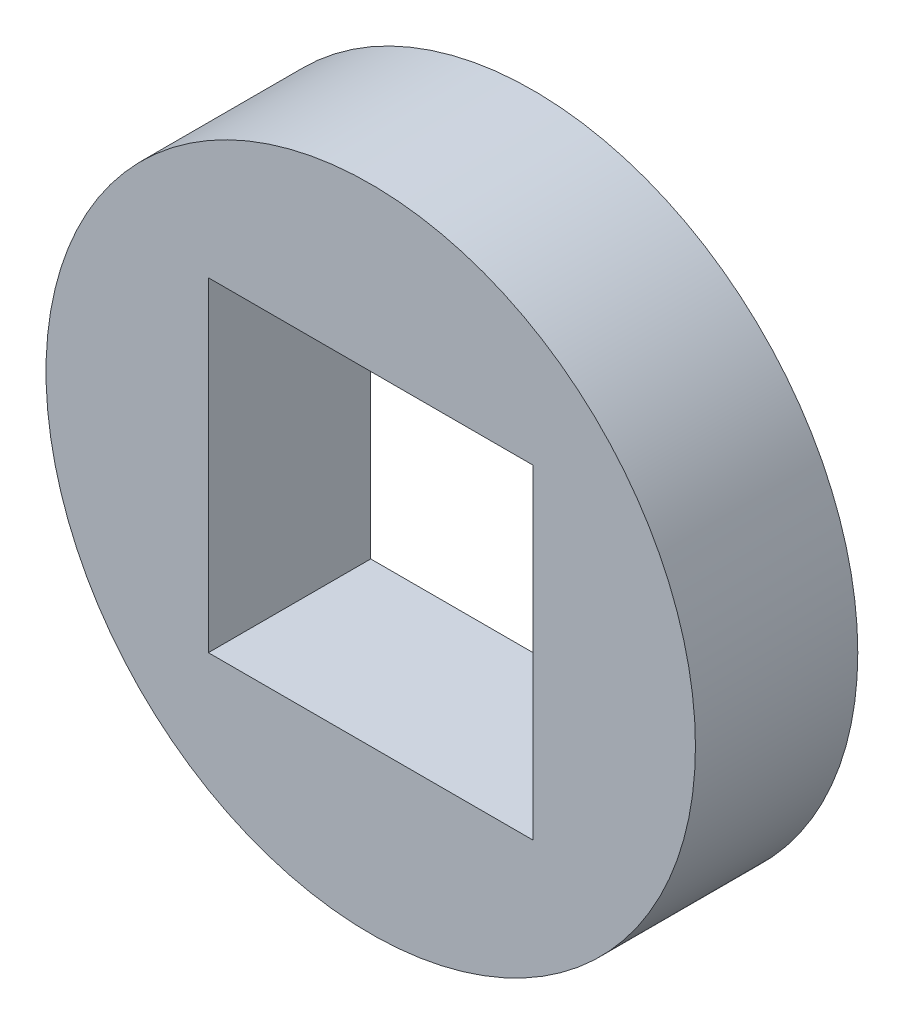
from build123d import *

# Parameters (mm, degrees)
SKETCH1_R           = 6.35
SKETCH1_W           = 6.35
SKETCH1_H           = 6.35
BOSS_EXTRUDE1_DEPTH = 3.175


with BuildPart() as part:
    # Sketch1 → Boss-Extrude1 (new body)
    with BuildSketch(Plane.XY):
        Circle(SKETCH1_R)
        Rectangle(SKETCH1_W, SKETCH1_H, mode=Mode.SUBTRACT)
    extrude(amount=BOSS_EXTRUDE1_DEPTH)


solid = part.part
